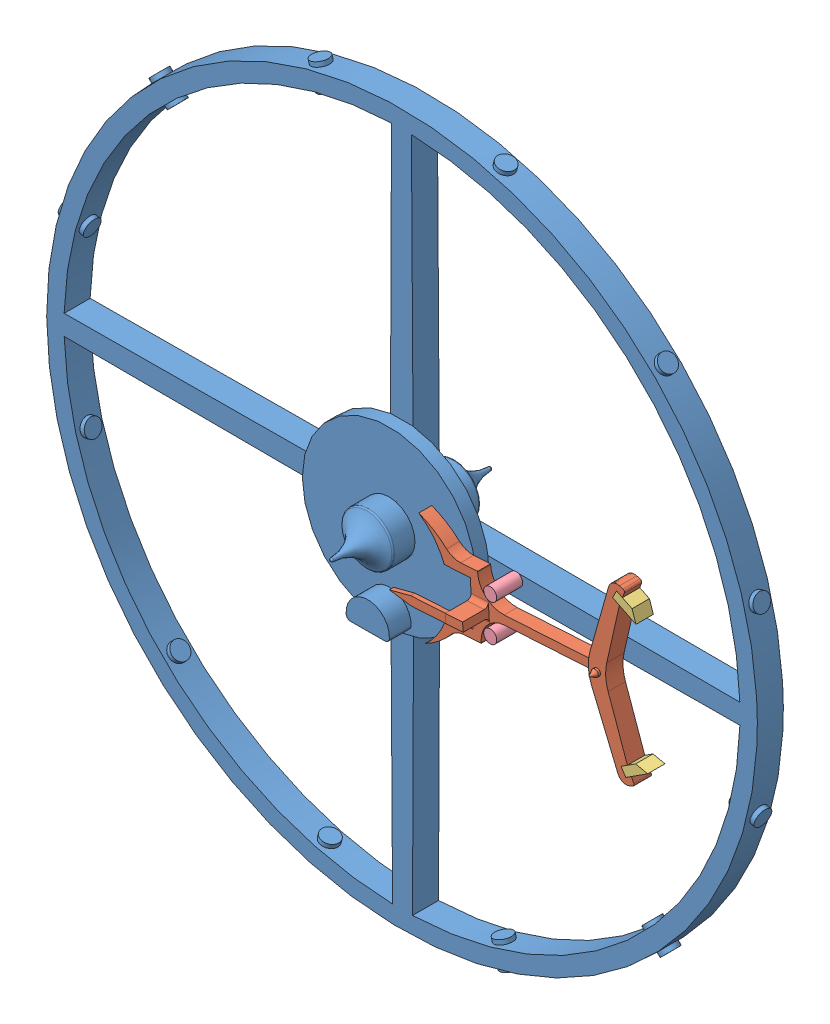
SolidWorks assembly Escapement test.SLDASM, configuration Default (file format 11000). Lengths in mm.
Overall size (100.31 82.45 18.53).
7 component instances, 5 part files, 17 mates.
Components (placement in the parent):
- Balancewheel-1: Balancewheel.SLDPRT [Default] at (0 0 -4.5) x (0.999985 0.005458 0) z (0 0 1) size (82 82 18.53)
- BalanceLever-1: BalanceLever.SLDPRT [Default] at (29.0376 0.1511 0.5) x (0.998232 0.059443 0) z (0 0 1) size (25.22 19.56 5.44)
- 15 Escape wheel-1: 15 Escape wheel.SLDPRT [Default] at (44.09 0 1) x (0.984264 0.176705 0) z (0 0 1) (suppressed, hidden)
- Pallet1-1: Pallet1.SLDPRT [Default] at (32.3413 -7.2576 0.5) x (0.839646 0.543133 0) z (0 0 1) size (3 1 2)
- Block-1: Block.SLDPRT [Default] at (14.6773 -2.1127 0) x (0.745886 0.666074 0) z (0 0 1) size (1.5 1.5 3)
- Block-2: Block.SLDPRT [Default] at (14.6773 2.1127 0) x (-0.922112 -0.386923 0) z (0 0 1) size (1.5 1.5 3)
- Pallet1-2: Pallet1.SLDPRT [Default] at (30.9991 7.0014 0.5) x (0.89817 -0.439649 0) z (0 0 1) size (3 1 2)
Mates (geometry in assembly coordinates):
- Concentric2: concentric: circle of ?
- Coincident3: coincident: plane of ? through (0 0 0) normal (0 0 1); plane of assembly through (0 0 0) normal (0 0 1)
- Distance1: distance = 0.5 mm: plane of assembly; plane of assembly; plane of BalanceLever-1 through (30.488 0.2375 0.5) normal (0 0 -1); plane of Balancewheel-1 through (0 0 0) normal (0 0 1)
- Coincident5: coincident: line of ? through (-0.0298 8.4999 -1.5) axis (0 0 1); line of ? through (8.5283 1.0082 -6.0718) axis (0 0 1)
- Coincident6: coincident: line of ? through (26.5 0 4.4744) axis (0 0 -1)
- Concentric3: concentric: circle of ?
- Coincident8: coincident: plane of ? through (30.4888 -0.2238 2.5) normal (0 0 1); plane of ? through (44.09 0 2.5) normal (0 0 1)
- Coincident9: coincident: unknown of ?; unknown of ?
- Coincident10: coincident: unknown of ?; unknown of ?
- Coincident24: coincident: plane of ? through (30.4888 -0.2238 2.5) normal (0 0 1); plane of ? through (31.4658 -7.8825 2.5) normal (0 0 1)
- Concentric8: concentric: cylinder of ? through (14.6773 -2.1127 3) axis (0 0 -1) radius 0.75
- Concentric9: concentric: cylinder of ? through (14.6773 2.1127 3) axis (0 0 -1) radius 0.75
- Coincident20: coincident: plane of ? through (14.6773 2.1127 0) normal (0 0 -1); plane of assembly through (0 0 0) normal (0 0 1)
- Coincident21: coincident: unknown of ?; unknown of ?
- Coincident22: coincident: unknown of ?; unknown of ?
- Coincident23: coincident: plane of ? through (30.4888 -0.2238 2.5) normal (0 0 1); plane of ? through (31.7761 6.4362 2.5) normal (0 0 1)
- Coincident27: coincident: plane of ? through (14.6773 -2.1127 0) normal (0 0 -1)
